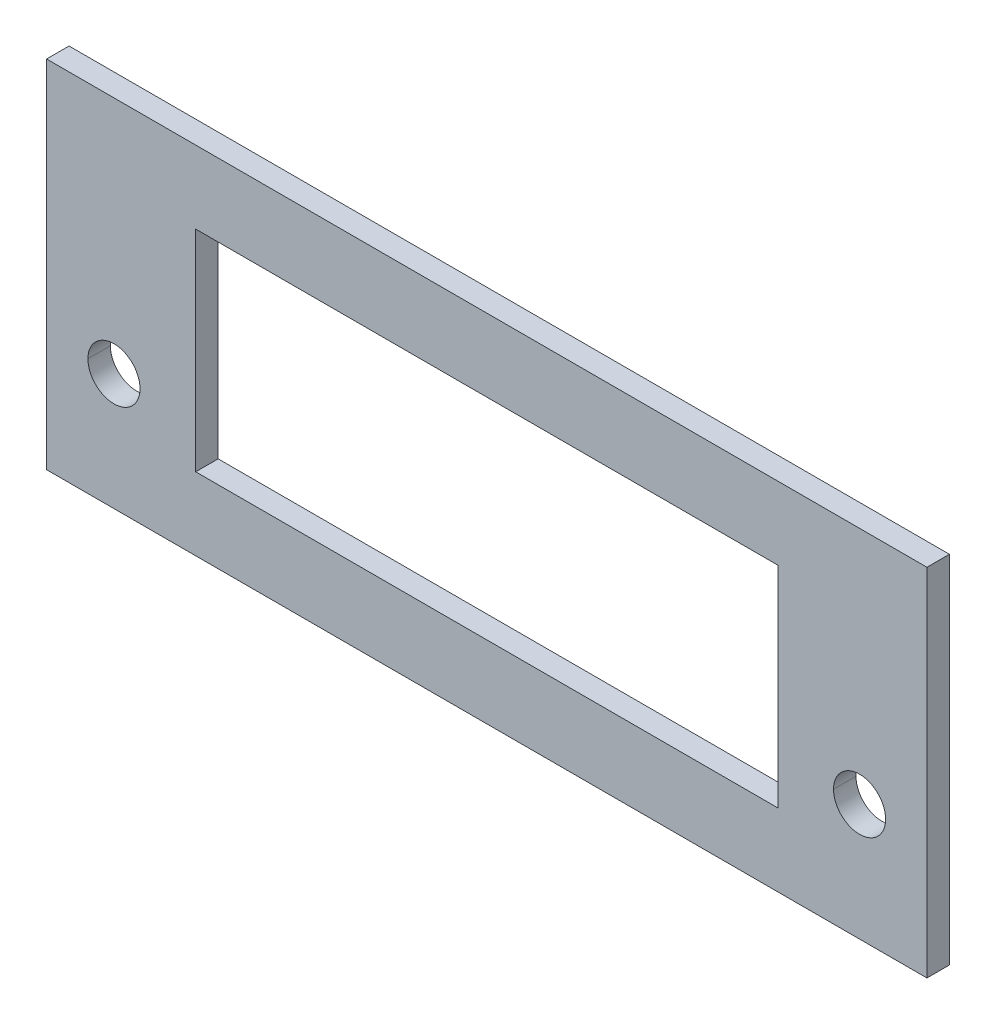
ISO-10303-21;
HEADER;
FILE_DESCRIPTION(('STEP AP214'),'2;1');
FILE_NAME('part.step','',(''),(''),'','','');
FILE_SCHEMA(('AUTOMOTIVE_DESIGN { 1 0 10303 214 1 1 1 1 }'));
ENDSEC;
DATA;
#1=APPLICATION_CONTEXT('core data for automotive mechanical design processes');
#2=APPLICATION_PROTOCOL_DEFINITION('international standard','automotive_design',2000,#1);
#3=PRODUCT_CONTEXT('',#1,'mechanical');
#4=PRODUCT('Part','Part','',(#3));
#5=PRODUCT_RELATED_PRODUCT_CATEGORY('part','',(#4));
#6=PRODUCT_DEFINITION_FORMATION('','',#4);
#7=PRODUCT_DEFINITION_CONTEXT('part definition',#1,'design');
#8=PRODUCT_DEFINITION('design','',#6,#7);
#9=PRODUCT_DEFINITION_SHAPE('','',#8);
#10=(LENGTH_UNIT() NAMED_UNIT(*) SI_UNIT(.MILLI.,.METRE.));
#11=(NAMED_UNIT(*) PLANE_ANGLE_UNIT() SI_UNIT($,.RADIAN.));
#12=(NAMED_UNIT(*) SI_UNIT($,.STERADIAN.) SOLID_ANGLE_UNIT());
#13=UNCERTAINTY_MEASURE_WITH_UNIT(LENGTH_MEASURE(1.E-05),#10,'distance_accuracy_value','');
#14=(GEOMETRIC_REPRESENTATION_CONTEXT(3) GLOBAL_UNCERTAINTY_ASSIGNED_CONTEXT((#13)) GLOBAL_UNIT_ASSIGNED_CONTEXT((#10,
#11,#12)) REPRESENTATION_CONTEXT('',''));
#15=CARTESIAN_POINT('',(0.,0.,0.));
#16=DIRECTION('',(0.,0.,1.));
#17=DIRECTION('',(1.,0.,0.));
#18=AXIS2_PLACEMENT_3D('',#15,#16,#17);
#19=CARTESIAN_POINT('',(41.5,13.,0.));
#20=DIRECTION('',(0.,0.,-1.));
#21=DIRECTION('',(-1.,0.,0.));
#22=AXIS2_PLACEMENT_3D('',#19,#20,#21);
#23=CYLINDRICAL_SURFACE('',#22,2.9);
#24=DIRECTION('',(0.,0.,-1.));
#25=VECTOR('',#24,1.);
#26=CARTESIAN_POINT('',(44.4,13.,0.));
#27=LINE('',#26,#25);
#28=CARTESIAN_POINT('',(44.4,13.,0.));
#29=VERTEX_POINT('',#28);
#30=CARTESIAN_POINT('',(44.4,13.,-2.5));
#31=VERTEX_POINT('',#30);
#32=EDGE_CURVE('E136',#29,#31,#27,.T.);
#33=ORIENTED_EDGE('',*,*,#32,.F.);
#34=CARTESIAN_POINT('',(41.5,13.,0.));
#35=DIRECTION('',(0.,0.,1.));
#36=DIRECTION('',(1.,0.,0.));
#37=AXIS2_PLACEMENT_3D('',#34,#35,#36);
#38=CIRCLE('',#37,2.9);
#39=CARTESIAN_POINT('',(38.6,13.,0.));
#40=VERTEX_POINT('',#39);
#41=EDGE_CURVE('E131',#29,#40,#38,.T.);
#42=ORIENTED_EDGE('',*,*,#41,.T.);
#43=DIRECTION('',(0.,0.,-1.));
#44=VECTOR('',#43,1.);
#45=CARTESIAN_POINT('',(38.6,13.,0.));
#46=LINE('',#45,#44);
#47=CARTESIAN_POINT('',(38.6,13.,-2.5));
#48=VERTEX_POINT('',#47);
#49=EDGE_CURVE('E133',#40,#48,#46,.T.);
#50=ORIENTED_EDGE('',*,*,#49,.T.);
#51=CARTESIAN_POINT('',(41.5,13.,-2.5));
#52=DIRECTION('',(0.,0.,1.));
#53=DIRECTION('',(1.,0.,0.));
#54=AXIS2_PLACEMENT_3D('',#51,#52,#53);
#55=CIRCLE('',#54,2.9);
#56=EDGE_CURVE('E242',#31,#48,#55,.T.);
#57=ORIENTED_EDGE('',*,*,#56,.F.);
#58=EDGE_LOOP('',(#33,#42,#50,#57));
#59=FACE_BOUND('',#58,.T.);
#60=ADVANCED_FACE('F15',(#59),#23,.F.);
#61=CARTESIAN_POINT('',(-41.5,13.,0.));
#62=DIRECTION('',(0.,0.,-1.));
#63=DIRECTION('',(-1.,0.,0.));
#64=AXIS2_PLACEMENT_3D('',#61,#62,#63);
#65=CYLINDRICAL_SURFACE('',#64,2.9);
#66=DIRECTION('',(0.,0.,-1.));
#67=VECTOR('',#66,1.);
#68=CARTESIAN_POINT('',(-38.6,13.,0.));
#69=LINE('',#68,#67);
#70=CARTESIAN_POINT('',(-38.6,13.,0.));
#71=VERTEX_POINT('',#70);
#72=CARTESIAN_POINT('',(-38.6,13.,-2.5));
#73=VERTEX_POINT('',#72);
#74=EDGE_CURVE('E182',#71,#73,#69,.T.);
#75=ORIENTED_EDGE('',*,*,#74,.F.);
#76=CARTESIAN_POINT('',(-41.5,13.,0.));
#77=DIRECTION('',(0.,0.,1.));
#78=DIRECTION('',(-1.,0.,0.));
#79=AXIS2_PLACEMENT_3D('',#76,#77,#78);
#80=CIRCLE('',#79,2.9);
#81=CARTESIAN_POINT('',(-44.4,13.,0.));
#82=VERTEX_POINT('',#81);
#83=EDGE_CURVE('E142',#71,#82,#80,.T.);
#84=ORIENTED_EDGE('',*,*,#83,.T.);
#85=DIRECTION('',(0.,0.,-1.));
#86=VECTOR('',#85,1.);
#87=CARTESIAN_POINT('',(-44.4,13.,0.));
#88=LINE('',#87,#86);
#89=CARTESIAN_POINT('',(-44.4,13.,-2.5));
#90=VERTEX_POINT('',#89);
#91=EDGE_CURVE('E190',#82,#90,#88,.T.);
#92=ORIENTED_EDGE('',*,*,#91,.T.);
#93=CARTESIAN_POINT('',(-41.5,13.,-2.5));
#94=DIRECTION('',(0.,0.,1.));
#95=DIRECTION('',(-1.,0.,0.));
#96=AXIS2_PLACEMENT_3D('',#93,#94,#95);
#97=CIRCLE('',#96,2.9);
#98=EDGE_CURVE('E223',#73,#90,#97,.T.);
#99=ORIENTED_EDGE('',*,*,#98,.F.);
#100=EDGE_LOOP('',(#75,#84,#92,#99));
#101=FACE_BOUND('',#100,.T.);
#102=ADVANCED_FACE('F268',(#101),#65,.F.);
#103=CARTESIAN_POINT('',(-32.4,8.1,0.));
#104=DIRECTION('',(0.,1.,0.));
#105=DIRECTION('',(1.,0.,0.));
#106=AXIS2_PLACEMENT_3D('',#103,#104,#105);
#107=PLANE('',#106);
#108=DIRECTION('',(1.,0.,0.));
#109=VECTOR('',#108,1.);
#110=CARTESIAN_POINT('',(-32.4,8.1,-2.5));
#111=LINE('',#110,#109);
#112=CARTESIAN_POINT('',(-32.4,8.1,-2.5));
#113=VERTEX_POINT('',#112);
#114=CARTESIAN_POINT('',(32.4,8.1,-2.5));
#115=VERTEX_POINT('',#114);
#116=EDGE_CURVE('E226',#113,#115,#111,.T.);
#117=ORIENTED_EDGE('',*,*,#116,.F.);
#118=DIRECTION('',(0.,0.,-1.));
#119=VECTOR('',#118,1.);
#120=CARTESIAN_POINT('',(-32.4,8.1,0.));
#121=LINE('',#120,#119);
#122=CARTESIAN_POINT('',(-32.4,8.1,0.));
#123=VERTEX_POINT('',#122);
#124=EDGE_CURVE('E10',#123,#113,#121,.T.);
#125=ORIENTED_EDGE('',*,*,#124,.F.);
#126=DIRECTION('',(1.,0.,0.));
#127=VECTOR('',#126,1.);
#128=CARTESIAN_POINT('',(-32.4,8.1,0.));
#129=LINE('',#128,#127);
#130=CARTESIAN_POINT('',(32.4,8.1,0.));
#131=VERTEX_POINT('',#130);
#132=EDGE_CURVE('E161',#123,#131,#129,.T.);
#133=ORIENTED_EDGE('',*,*,#132,.T.);
#134=DIRECTION('',(0.,0.,-1.));
#135=VECTOR('',#134,1.);
#136=CARTESIAN_POINT('',(32.4,8.1,0.));
#137=LINE('',#136,#135);
#138=EDGE_CURVE('E257',#131,#115,#137,.T.);
#139=ORIENTED_EDGE('',*,*,#138,.T.);
#140=EDGE_LOOP('',(#117,#125,#133,#139));
#141=FACE_BOUND('',#140,.T.);
#142=ADVANCED_FACE('F264',(#141),#107,.T.);
#143=CARTESIAN_POINT('',(-32.4,8.1,0.));
#144=DIRECTION('',(1.,0.,0.));
#145=DIRECTION('',(0.,1.,0.));
#146=AXIS2_PLACEMENT_3D('',#143,#144,#145);
#147=PLANE('',#146);
#148=DIRECTION('',(0.,-1.,0.));
#149=VECTOR('',#148,1.);
#150=CARTESIAN_POINT('',(-32.4,8.1,-2.5));
#151=LINE('',#150,#149);
#152=CARTESIAN_POINT('',(-32.4,31.5,-2.5));
#153=VERTEX_POINT('',#152);
#154=EDGE_CURVE('E238',#153,#113,#151,.T.);
#155=ORIENTED_EDGE('',*,*,#154,.F.);
#156=DIRECTION('',(0.,0.,-1.));
#157=VECTOR('',#156,1.);
#158=CARTESIAN_POINT('',(-32.4,31.5,0.));
#159=LINE('',#158,#157);
#160=CARTESIAN_POINT('',(-32.4,31.5,0.));
#161=VERTEX_POINT('',#160);
#162=EDGE_CURVE('E19',#161,#153,#159,.T.);
#163=ORIENTED_EDGE('',*,*,#162,.F.);
#164=DIRECTION('',(0.,-1.,0.));
#165=VECTOR('',#164,1.);
#166=CARTESIAN_POINT('',(-32.4,8.1,0.));
#167=LINE('',#166,#165);
#168=EDGE_CURVE('E178',#161,#123,#167,.T.);
#169=ORIENTED_EDGE('',*,*,#168,.T.);
#170=ORIENTED_EDGE('',*,*,#124,.T.);
#171=EDGE_LOOP('',(#155,#163,#169,#170));
#172=FACE_BOUND('',#171,.T.);
#173=ADVANCED_FACE('F17',(#172),#147,.T.);
#174=CARTESIAN_POINT('',(-32.4,31.5,0.));
#175=DIRECTION('',(0.,-1.,0.));
#176=DIRECTION('',(0.,0.,-1.));
#177=AXIS2_PLACEMENT_3D('',#174,#175,#176);
#178=PLANE('',#177);
#179=DIRECTION('',(-1.,0.,0.));
#180=VECTOR('',#179,1.);
#181=CARTESIAN_POINT('',(-32.4,31.5,-2.5));
#182=LINE('',#181,#180);
#183=CARTESIAN_POINT('',(32.4,31.5,-2.5));
#184=VERTEX_POINT('',#183);
#185=EDGE_CURVE('E234',#184,#153,#182,.T.);
#186=ORIENTED_EDGE('',*,*,#185,.F.);
#187=DIRECTION('',(0.,0.,-1.));
#188=VECTOR('',#187,1.);
#189=CARTESIAN_POINT('',(32.4,31.5,0.));
#190=LINE('',#189,#188);
#191=CARTESIAN_POINT('',(32.4,31.5,0.));
#192=VERTEX_POINT('',#191);
#193=EDGE_CURVE('E43',#192,#184,#190,.T.);
#194=ORIENTED_EDGE('',*,*,#193,.F.);
#195=DIRECTION('',(-1.,0.,0.));
#196=VECTOR('',#195,1.);
#197=CARTESIAN_POINT('',(-32.4,31.5,0.));
#198=LINE('',#197,#196);
#199=EDGE_CURVE('E175',#192,#161,#198,.T.);
#200=ORIENTED_EDGE('',*,*,#199,.T.);
#201=ORIENTED_EDGE('',*,*,#162,.T.);
#202=EDGE_LOOP('',(#186,#194,#200,#201));
#203=FACE_BOUND('',#202,.T.);
#204=ADVANCED_FACE('F363',(#203),#178,.T.);
#205=CARTESIAN_POINT('',(32.4,8.1,0.));
#206=DIRECTION('',(-1.,0.,0.));
#207=DIRECTION('',(0.,0.,1.));
#208=AXIS2_PLACEMENT_3D('',#205,#206,#207);
#209=PLANE('',#208);
#210=DIRECTION('',(0.,1.,0.));
#211=VECTOR('',#210,1.);
#212=CARTESIAN_POINT('',(32.4,8.1,-2.5));
#213=LINE('',#212,#211);
#214=EDGE_CURVE('E230',#115,#184,#213,.T.);
#215=ORIENTED_EDGE('',*,*,#214,.F.);
#216=ORIENTED_EDGE('',*,*,#138,.F.);
#217=DIRECTION('',(0.,1.,0.));
#218=VECTOR('',#217,1.);
#219=CARTESIAN_POINT('',(32.4,8.1,0.));
#220=LINE('',#219,#218);
#221=EDGE_CURVE('E160',#131,#192,#220,.T.);
#222=ORIENTED_EDGE('',*,*,#221,.T.);
#223=ORIENTED_EDGE('',*,*,#193,.T.);
#224=EDGE_LOOP('',(#215,#216,#222,#223));
#225=FACE_BOUND('',#224,.T.);
#226=ADVANCED_FACE('F354',(#225),#209,.T.);
#227=CARTESIAN_POINT('',(-49.,0.,0.));
#228=DIRECTION('',(0.,1.,0.));
#229=DIRECTION('',(1.,0.,0.));
#230=AXIS2_PLACEMENT_3D('',#227,#228,#229);
#231=PLANE('',#230);
#232=DIRECTION('',(1.,0.,0.));
#233=VECTOR('',#232,1.);
#234=CARTESIAN_POINT('',(-49.,0.,-2.5));
#235=LINE('',#234,#233);
#236=CARTESIAN_POINT('',(-49.,0.,-2.5));
#237=VERTEX_POINT('',#236);
#238=CARTESIAN_POINT('',(49.,0.,-2.5));
#239=VERTEX_POINT('',#238);
#240=EDGE_CURVE('E211',#237,#239,#235,.T.);
#241=ORIENTED_EDGE('',*,*,#240,.T.);
#242=DIRECTION('',(0.,0.,-1.));
#243=VECTOR('',#242,1.);
#244=CARTESIAN_POINT('',(49.,0.,0.));
#245=LINE('',#244,#243);
#246=CARTESIAN_POINT('',(49.,0.,0.));
#247=VERTEX_POINT('',#246);
#248=EDGE_CURVE('E248',#247,#239,#245,.T.);
#249=ORIENTED_EDGE('',*,*,#248,.F.);
#250=DIRECTION('',(1.,0.,0.));
#251=VECTOR('',#250,1.);
#252=CARTESIAN_POINT('',(-49.,0.,0.));
#253=LINE('',#252,#251);
#254=CARTESIAN_POINT('',(-49.,0.,0.));
#255=VERTEX_POINT('',#254);
#256=EDGE_CURVE('E162',#255,#247,#253,.T.);
#257=ORIENTED_EDGE('',*,*,#256,.F.);
#258=DIRECTION('',(0.,0.,-1.));
#259=VECTOR('',#258,1.);
#260=CARTESIAN_POINT('',(-49.,0.,0.));
#261=LINE('',#260,#259);
#262=EDGE_CURVE('E254',#255,#237,#261,.T.);
#263=ORIENTED_EDGE('',*,*,#262,.T.);
#264=EDGE_LOOP('',(#241,#249,#257,#263));
#265=FACE_BOUND('',#264,.T.);
#266=ADVANCED_FACE('F345',(#265),#231,.F.);
#267=CARTESIAN_POINT('',(-49.,0.,0.));
#268=DIRECTION('',(1.,0.,0.));
#269=DIRECTION('',(0.,1.,0.));
#270=AXIS2_PLACEMENT_3D('',#267,#268,#269);
#271=PLANE('',#270);
#272=DIRECTION('',(0.,-1.,0.));
#273=VECTOR('',#272,1.);
#274=CARTESIAN_POINT('',(-49.,0.,-2.5));
#275=LINE('',#274,#273);
#276=CARTESIAN_POINT('',(-49.,39.6,-2.5));
#277=VERTEX_POINT('',#276);
#278=EDGE_CURVE('E215',#277,#237,#275,.T.);
#279=ORIENTED_EDGE('',*,*,#278,.T.);
#280=ORIENTED_EDGE('',*,*,#262,.F.);
#281=DIRECTION('',(0.,-1.,0.));
#282=VECTOR('',#281,1.);
#283=CARTESIAN_POINT('',(-49.,0.,0.));
#284=LINE('',#283,#282);
#285=CARTESIAN_POINT('',(-49.,39.6,0.));
#286=VERTEX_POINT('',#285);
#287=EDGE_CURVE('E168',#286,#255,#284,.T.);
#288=ORIENTED_EDGE('',*,*,#287,.F.);
#289=DIRECTION('',(0.,0.,-1.));
#290=VECTOR('',#289,1.);
#291=CARTESIAN_POINT('',(-49.,39.6,0.));
#292=LINE('',#291,#290);
#293=EDGE_CURVE('E251',#286,#277,#292,.T.);
#294=ORIENTED_EDGE('',*,*,#293,.T.);
#295=EDGE_LOOP('',(#279,#280,#288,#294));
#296=FACE_BOUND('',#295,.T.);
#297=ADVANCED_FACE('F299',(#296),#271,.F.);
#298=CARTESIAN_POINT('',(-49.,39.6,0.));
#299=DIRECTION('',(0.,-1.,0.));
#300=DIRECTION('',(0.,0.,-1.));
#301=AXIS2_PLACEMENT_3D('',#298,#299,#300);
#302=PLANE('',#301);
#303=DIRECTION('',(-1.,0.,0.));
#304=VECTOR('',#303,1.);
#305=CARTESIAN_POINT('',(-49.,39.6,-2.5));
#306=LINE('',#305,#304);
#307=CARTESIAN_POINT('',(49.,39.6,-2.5));
#308=VERTEX_POINT('',#307);
#309=EDGE_CURVE('E219',#308,#277,#306,.T.);
#310=ORIENTED_EDGE('',*,*,#309,.T.);
#311=ORIENTED_EDGE('',*,*,#293,.F.);
#312=DIRECTION('',(-1.,0.,0.));
#313=VECTOR('',#312,1.);
#314=CARTESIAN_POINT('',(-49.,39.6,0.));
#315=LINE('',#314,#313);
#316=CARTESIAN_POINT('',(49.,39.6,0.));
#317=VERTEX_POINT('',#316);
#318=EDGE_CURVE('E164',#317,#286,#315,.T.);
#319=ORIENTED_EDGE('',*,*,#318,.F.);
#320=DIRECTION('',(0.,0.,-1.));
#321=VECTOR('',#320,1.);
#322=CARTESIAN_POINT('',(49.,39.6,0.));
#323=LINE('',#322,#321);
#324=EDGE_CURVE('E245',#317,#308,#323,.T.);
#325=ORIENTED_EDGE('',*,*,#324,.T.);
#326=EDGE_LOOP('',(#310,#311,#319,#325));
#327=FACE_BOUND('',#326,.T.);
#328=ADVANCED_FACE('F294',(#327),#302,.F.);
#329=CARTESIAN_POINT('',(49.,0.,0.));
#330=DIRECTION('',(-1.,0.,0.));
#331=DIRECTION('',(0.,0.,1.));
#332=AXIS2_PLACEMENT_3D('',#329,#330,#331);
#333=PLANE('',#332);
#334=DIRECTION('',(0.,1.,0.));
#335=VECTOR('',#334,1.);
#336=CARTESIAN_POINT('',(49.,0.,-2.5));
#337=LINE('',#336,#335);
#338=EDGE_CURVE('E141',#239,#308,#337,.T.);
#339=ORIENTED_EDGE('',*,*,#338,.T.);
#340=ORIENTED_EDGE('',*,*,#324,.F.);
#341=DIRECTION('',(0.,1.,0.));
#342=VECTOR('',#341,1.);
#343=CARTESIAN_POINT('',(49.,0.,0.));
#344=LINE('',#343,#342);
#345=EDGE_CURVE('E169',#247,#317,#344,.T.);
#346=ORIENTED_EDGE('',*,*,#345,.F.);
#347=ORIENTED_EDGE('',*,*,#248,.T.);
#348=EDGE_LOOP('',(#339,#340,#346,#347));
#349=FACE_BOUND('',#348,.T.);
#350=ADVANCED_FACE('F298',(#349),#333,.F.);
#351=CARTESIAN_POINT('',(0.,19.8,-2.5));
#352=DIRECTION('',(0.,0.,-1.));
#353=DIRECTION('',(0.,-1.,0.));
#354=AXIS2_PLACEMENT_3D('',#351,#352,#353);
#355=PLANE('',#354);
#356=CARTESIAN_POINT('',(41.5,13.,-2.5));
#357=DIRECTION('',(0.,0.,1.));
#358=DIRECTION('',(1.,0.,0.));
#359=AXIS2_PLACEMENT_3D('',#356,#357,#358);
#360=CIRCLE('',#359,2.9);
#361=EDGE_CURVE('E148',#48,#31,#360,.T.);
#362=ORIENTED_EDGE('',*,*,#361,.T.);
#363=ORIENTED_EDGE('',*,*,#56,.T.);
#364=EDGE_LOOP('',(#362,#363));
#365=FACE_BOUND('',#364,.T.);
#366=ORIENTED_EDGE('',*,*,#116,.T.);
#367=ORIENTED_EDGE('',*,*,#214,.T.);
#368=ORIENTED_EDGE('',*,*,#185,.T.);
#369=ORIENTED_EDGE('',*,*,#154,.T.);
#370=EDGE_LOOP('',(#366,#367,#368,#369));
#371=FACE_BOUND('',#370,.T.);
#372=CARTESIAN_POINT('',(-41.5,13.,-2.5));
#373=DIRECTION('',(0.,0.,1.));
#374=DIRECTION('',(-1.,0.,0.));
#375=AXIS2_PLACEMENT_3D('',#372,#373,#374);
#376=CIRCLE('',#375,2.9);
#377=EDGE_CURVE('E185',#90,#73,#376,.T.);
#378=ORIENTED_EDGE('',*,*,#377,.T.);
#379=ORIENTED_EDGE('',*,*,#98,.T.);
#380=EDGE_LOOP('',(#378,#379));
#381=FACE_BOUND('',#380,.T.);
#382=ORIENTED_EDGE('',*,*,#338,.F.);
#383=ORIENTED_EDGE('',*,*,#240,.F.);
#384=ORIENTED_EDGE('',*,*,#278,.F.);
#385=ORIENTED_EDGE('',*,*,#309,.F.);
#386=EDGE_LOOP('',(#382,#383,#384,#385));
#387=FACE_BOUND('',#386,.T.);
#388=ADVANCED_FACE('F323',(#365,#371,#381,#387),#355,.T.);
#389=CARTESIAN_POINT('',(0.,19.8,0.));
#390=DIRECTION('',(0.,0.,-1.));
#391=DIRECTION('',(0.,-1.,0.));
#392=AXIS2_PLACEMENT_3D('',#389,#390,#391);
#393=PLANE('',#392);
#394=CARTESIAN_POINT('',(41.5,13.,0.));
#395=DIRECTION('',(0.,0.,1.));
#396=DIRECTION('',(1.,0.,0.));
#397=AXIS2_PLACEMENT_3D('',#394,#395,#396);
#398=CIRCLE('',#397,2.9);
#399=EDGE_CURVE('E146',#40,#29,#398,.T.);
#400=ORIENTED_EDGE('',*,*,#399,.F.);
#401=ORIENTED_EDGE('',*,*,#41,.F.);
#402=EDGE_LOOP('',(#400,#401));
#403=FACE_BOUND('',#402,.T.);
#404=CARTESIAN_POINT('',(-41.5,13.,0.));
#405=DIRECTION('',(0.,0.,1.));
#406=DIRECTION('',(-1.,0.,0.));
#407=AXIS2_PLACEMENT_3D('',#404,#405,#406);
#408=CIRCLE('',#407,2.9);
#409=EDGE_CURVE('E150',#82,#71,#408,.T.);
#410=ORIENTED_EDGE('',*,*,#409,.F.);
#411=ORIENTED_EDGE('',*,*,#83,.F.);
#412=EDGE_LOOP('',(#410,#411));
#413=FACE_BOUND('',#412,.T.);
#414=ORIENTED_EDGE('',*,*,#221,.F.);
#415=ORIENTED_EDGE('',*,*,#132,.F.);
#416=ORIENTED_EDGE('',*,*,#168,.F.);
#417=ORIENTED_EDGE('',*,*,#199,.F.);
#418=EDGE_LOOP('',(#414,#415,#416,#417));
#419=FACE_BOUND('',#418,.T.);
#420=ORIENTED_EDGE('',*,*,#345,.T.);
#421=ORIENTED_EDGE('',*,*,#318,.T.);
#422=ORIENTED_EDGE('',*,*,#287,.T.);
#423=ORIENTED_EDGE('',*,*,#256,.T.);
#424=EDGE_LOOP('',(#420,#421,#422,#423));
#425=FACE_BOUND('',#424,.T.);
#426=ADVANCED_FACE('F152',(#403,#413,#419,#425),#393,.F.);
#427=CARTESIAN_POINT('',(-41.5,13.,0.));
#428=DIRECTION('',(0.,0.,-1.));
#429=DIRECTION('',(-1.,0.,0.));
#430=AXIS2_PLACEMENT_3D('',#427,#428,#429);
#431=CYLINDRICAL_SURFACE('',#430,2.9);
#432=ORIENTED_EDGE('',*,*,#409,.T.);
#433=ORIENTED_EDGE('',*,*,#74,.T.);
#434=ORIENTED_EDGE('',*,*,#377,.F.);
#435=ORIENTED_EDGE('',*,*,#91,.F.);
#436=EDGE_LOOP('',(#432,#433,#434,#435));
#437=FACE_BOUND('',#436,.T.);
#438=ADVANCED_FACE('F280',(#437),#431,.F.);
#439=CARTESIAN_POINT('',(41.5,13.,0.));
#440=DIRECTION('',(0.,0.,-1.));
#441=DIRECTION('',(-1.,0.,0.));
#442=AXIS2_PLACEMENT_3D('',#439,#440,#441);
#443=CYLINDRICAL_SURFACE('',#442,2.9);
#444=ORIENTED_EDGE('',*,*,#399,.T.);
#445=ORIENTED_EDGE('',*,*,#32,.T.);
#446=ORIENTED_EDGE('',*,*,#361,.F.);
#447=ORIENTED_EDGE('',*,*,#49,.F.);
#448=EDGE_LOOP('',(#444,#445,#446,#447));
#449=FACE_BOUND('',#448,.T.);
#450=ADVANCED_FACE('F145',(#449),#443,.F.);
#451=CLOSED_SHELL('',(#60,#102,#142,#173,#204,#226,#266,#297,#328,#350,#388,#426,#438,#450));
#452=MANIFOLD_SOLID_BREP('B1',#451);
#453=ADVANCED_BREP_SHAPE_REPRESENTATION('',(#18,#452),#14);
#454=SHAPE_DEFINITION_REPRESENTATION(#9,#453);
ENDSEC;
END-ISO-10303-21;
